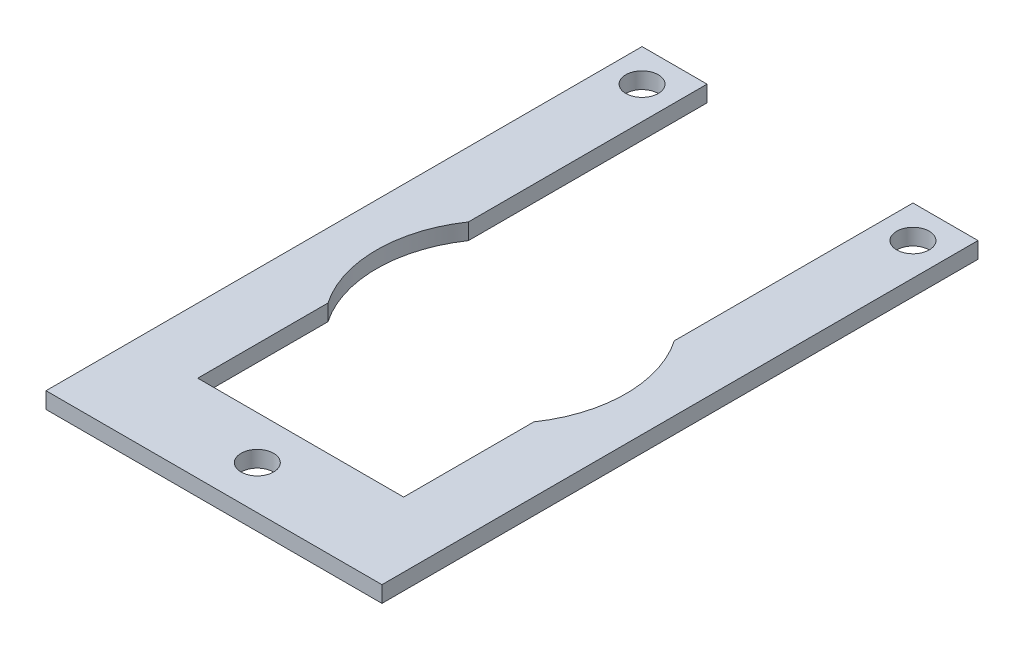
from build123d import *

# Parameters (mm, degrees)
SKETCH1_R      = 3
EXTRUDE1_DEPTH = 3


with BuildPart() as part:
    # Sketch1 → Extrude1 (new body)
    with BuildSketch(Plane(origin=(0, 0, 0), x_dir=(1, 0, 0), z_dir=(0, 1, 0))):
        with BuildLine():
            Line((50, 65.961481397), (50, 110))
            Line((50, 110), (62, 110))
            Line((62, 110), (62, 0))
            Line((62, 0), (0, 0))
            Line((0, 0), (0, 110))
            Line((0, 110), (12, 110))
            Line((12, 110), (12, 65.961481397))
            ThreePointArc((12, 65.961481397), (8, 53), (12, 40.038518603))
            Line((12, 40.038518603), (12, 16))
            Line((12, 16), (50, 16))
            Line((50, 16), (50, 40.038518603))
            ThreePointArc((50, 40.038518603), (54, 53), (50, 65.961481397))
        make_face()
        with Locations(Location((6, 104, 0), (0, 0, 270))):
            Circle(SKETCH1_R, mode=Mode.SUBTRACT)
        with Locations(Location((56, 104, 0), (0, 0, 270))):
            Circle(SKETCH1_R, mode=Mode.SUBTRACT)
        with Locations(Location((31, 8, 0), (0, 0, 270))):
            Circle(SKETCH1_R, mode=Mode.SUBTRACT)
    extrude(amount=EXTRUDE1_DEPTH)


solid = part.part
